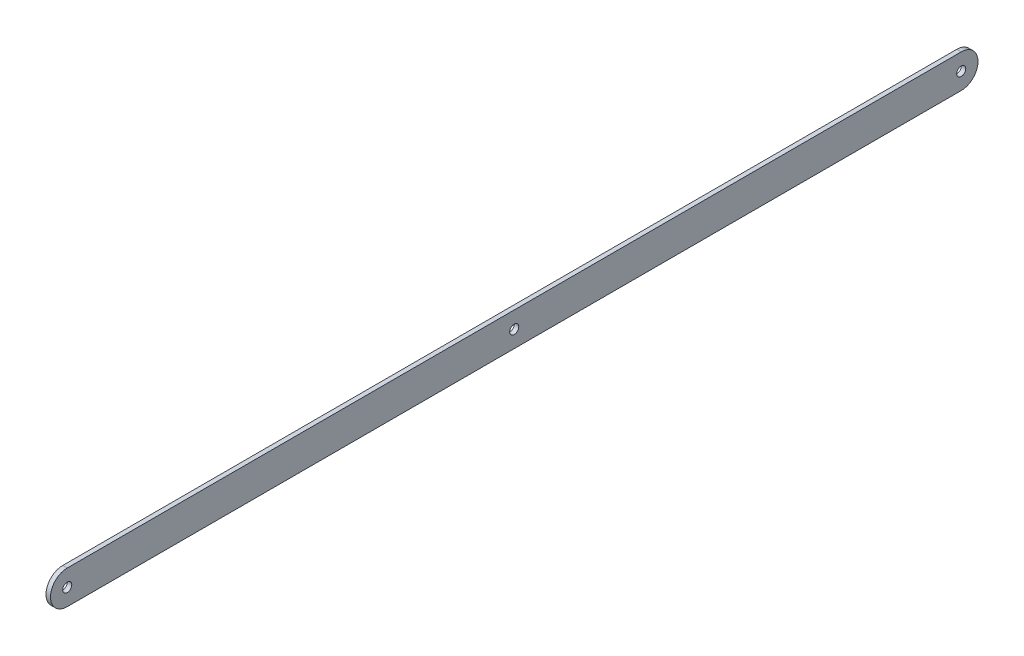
from build123d import *

# Parameters (mm, degrees)
SCHIZZO1_R                   = 4.05
ESTRUSIONE_ESTRUSIONE1_DEPTH = 4


with BuildPart() as part:
    # Schizzo1 → Estrusione-Estrusione1 (new body)
    with BuildSketch(Plane(origin=(0, 0, 0), x_dir=(0, 0, -1), z_dir=(1, 0, 0))):
        with BuildLine():
            Line((-400, 15), (400, 15))
            ThreePointArc((400, 15), (415, 0), (400, -15))
            Line((400, -15), (-400, -15))
            ThreePointArc((-400, -15), (-415, 0), (-400, 15))
        make_face()
        with Locations((400, 0)):
            Circle(SCHIZZO1_R, mode=Mode.SUBTRACT)
        with Locations((-400, 0)):
            Circle(SCHIZZO1_R, mode=Mode.SUBTRACT)
        Circle(SCHIZZO1_R, mode=Mode.SUBTRACT)
    extrude(amount=ESTRUSIONE_ESTRUSIONE1_DEPTH)


solid = part.part
